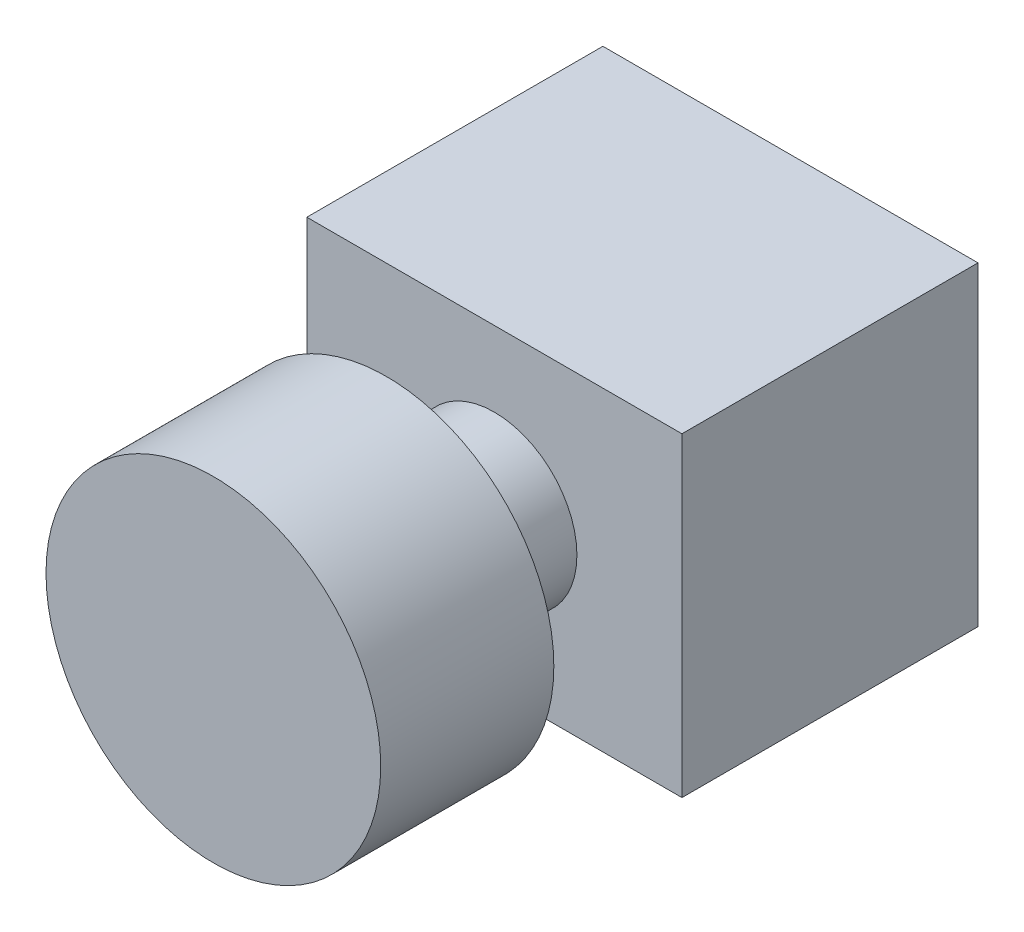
ISO-10303-21;
HEADER;
FILE_DESCRIPTION(('STEP AP214'),'2;1');
FILE_NAME('part.step','',(''),(''),'','','');
FILE_SCHEMA(('AUTOMOTIVE_DESIGN { 1 0 10303 214 1 1 1 1 }'));
ENDSEC;
DATA;
#1=APPLICATION_CONTEXT('core data for automotive mechanical design processes');
#2=APPLICATION_PROTOCOL_DEFINITION('international standard','automotive_design',2000,#1);
#3=PRODUCT_CONTEXT('',#1,'mechanical');
#4=PRODUCT('Part','Part','',(#3));
#5=PRODUCT_RELATED_PRODUCT_CATEGORY('part','',(#4));
#6=PRODUCT_DEFINITION_FORMATION('','',#4);
#7=PRODUCT_DEFINITION_CONTEXT('part definition',#1,'design');
#8=PRODUCT_DEFINITION('design','',#6,#7);
#9=PRODUCT_DEFINITION_SHAPE('','',#8);
#10=(LENGTH_UNIT() NAMED_UNIT(*) SI_UNIT(.MILLI.,.METRE.));
#11=(NAMED_UNIT(*) PLANE_ANGLE_UNIT() SI_UNIT($,.RADIAN.));
#12=(NAMED_UNIT(*) SI_UNIT($,.STERADIAN.) SOLID_ANGLE_UNIT());
#13=UNCERTAINTY_MEASURE_WITH_UNIT(LENGTH_MEASURE(1.E-05),#10,'distance_accuracy_value','');
#14=(GEOMETRIC_REPRESENTATION_CONTEXT(3) GLOBAL_UNCERTAINTY_ASSIGNED_CONTEXT((#13)) GLOBAL_UNIT_ASSIGNED_CONTEXT((#10,
#11,#12)) REPRESENTATION_CONTEXT('',''));
#15=CARTESIAN_POINT('',(0.,0.,0.));
#16=DIRECTION('',(0.,0.,1.));
#17=DIRECTION('',(1.,0.,0.));
#18=AXIS2_PLACEMENT_3D('',#15,#16,#17);
#19=CARTESIAN_POINT('',(0.,0.,25.4));
#20=DIRECTION('',(0.,0.,-1.));
#21=DIRECTION('',(-1.,0.,0.));
#22=AXIS2_PLACEMENT_3D('',#19,#20,#21);
#23=CYLINDRICAL_SURFACE('',#22,3.6322);
#24=CARTESIAN_POINT('',(0.,0.,13.0302));
#25=DIRECTION('',(0.,0.,1.));
#26=DIRECTION('',(1.,0.,0.));
#27=AXIS2_PLACEMENT_3D('',#24,#25,#26);
#28=CIRCLE('',#27,3.6322);
#29=CARTESIAN_POINT('',(3.6322,0.,13.0302));
#30=VERTEX_POINT('',#29);
#31=EDGE_CURVE('E48',#30,#30,#28,.T.);
#32=ORIENTED_EDGE('',*,*,#31,.T.);
#33=EDGE_LOOP('',(#32));
#34=FACE_BOUND('',#33,.T.);
#35=CARTESIAN_POINT('',(0.,0.,17.78));
#36=DIRECTION('',(0.,0.,1.));
#37=DIRECTION('',(1.,0.,0.));
#38=AXIS2_PLACEMENT_3D('',#35,#36,#37);
#39=CIRCLE('',#38,3.6322);
#40=CARTESIAN_POINT('',(3.6322,0.,17.78));
#41=VERTEX_POINT('',#40);
#42=EDGE_CURVE('E11',#41,#41,#39,.T.);
#43=ORIENTED_EDGE('',*,*,#42,.F.);
#44=EDGE_LOOP('',(#43));
#45=FACE_BOUND('',#44,.T.);
#46=ADVANCED_FACE('F39',(#34,#45),#23,.T.);
#47=CARTESIAN_POINT('',(8.255,-6.9342,13.0302));
#48=DIRECTION('',(-1.,0.,0.));
#49=DIRECTION('',(0.,0.,1.));
#50=AXIS2_PLACEMENT_3D('',#47,#48,#49);
#51=PLANE('',#50);
#52=DIRECTION('',(0.,1.,0.));
#53=VECTOR('',#52,1.);
#54=CARTESIAN_POINT('',(8.255,-6.9342,0.));
#55=LINE('',#54,#53);
#56=CARTESIAN_POINT('',(8.255,-6.9342,0.));
#57=VERTEX_POINT('',#56);
#58=CARTESIAN_POINT('',(8.255,6.9342,0.));
#59=VERTEX_POINT('',#58);
#60=EDGE_CURVE('E107',#57,#59,#55,.T.);
#61=ORIENTED_EDGE('',*,*,#60,.T.);
#62=DIRECTION('',(0.,0.,-1.));
#63=VECTOR('',#62,1.);
#64=CARTESIAN_POINT('',(8.255,6.9342,13.0302));
#65=LINE('',#64,#63);
#66=CARTESIAN_POINT('',(8.255,6.9342,13.0302));
#67=VERTEX_POINT('',#66);
#68=EDGE_CURVE('E98',#67,#59,#65,.T.);
#69=ORIENTED_EDGE('',*,*,#68,.F.);
#70=DIRECTION('',(0.,1.,0.));
#71=VECTOR('',#70,1.);
#72=CARTESIAN_POINT('',(8.255,-6.9342,13.0302));
#73=LINE('',#72,#71);
#74=CARTESIAN_POINT('',(8.255,-6.9342,13.0302));
#75=VERTEX_POINT('',#74);
#76=EDGE_CURVE('E92',#75,#67,#73,.T.);
#77=ORIENTED_EDGE('',*,*,#76,.F.);
#78=DIRECTION('',(0.,0.,-1.));
#79=VECTOR('',#78,1.);
#80=CARTESIAN_POINT('',(8.255,-6.9342,13.0302));
#81=LINE('',#80,#79);
#82=EDGE_CURVE('E103',#75,#57,#81,.T.);
#83=ORIENTED_EDGE('',*,*,#82,.T.);
#84=EDGE_LOOP('',(#61,#69,#77,#83));
#85=FACE_BOUND('',#84,.T.);
#86=ADVANCED_FACE('F41',(#85),#51,.F.);
#87=CARTESIAN_POINT('',(-8.255,6.9342,13.0302));
#88=DIRECTION('',(0.,-1.,0.));
#89=DIRECTION('',(0.,0.,-1.));
#90=AXIS2_PLACEMENT_3D('',#87,#88,#89);
#91=PLANE('',#90);
#92=DIRECTION('',(-1.,0.,0.));
#93=VECTOR('',#92,1.);
#94=CARTESIAN_POINT('',(-8.255,6.9342,0.));
#95=LINE('',#94,#93);
#96=CARTESIAN_POINT('',(-8.255,6.9342,0.));
#97=VERTEX_POINT('',#96);
#98=EDGE_CURVE('E97',#59,#97,#95,.T.);
#99=ORIENTED_EDGE('',*,*,#98,.T.);
#100=DIRECTION('',(0.,0.,-1.));
#101=VECTOR('',#100,1.);
#102=CARTESIAN_POINT('',(-8.255,6.9342,13.0302));
#103=LINE('',#102,#101);
#104=CARTESIAN_POINT('',(-8.255,6.9342,13.0302));
#105=VERTEX_POINT('',#104);
#106=EDGE_CURVE('E95',#105,#97,#103,.T.);
#107=ORIENTED_EDGE('',*,*,#106,.F.);
#108=DIRECTION('',(-1.,0.,0.));
#109=VECTOR('',#108,1.);
#110=CARTESIAN_POINT('',(-8.255,6.9342,13.0302));
#111=LINE('',#110,#109);
#112=EDGE_CURVE('E87',#67,#105,#111,.T.);
#113=ORIENTED_EDGE('',*,*,#112,.F.);
#114=ORIENTED_EDGE('',*,*,#68,.T.);
#115=EDGE_LOOP('',(#99,#107,#113,#114));
#116=FACE_BOUND('',#115,.T.);
#117=ADVANCED_FACE('F96',(#116),#91,.F.);
#118=CARTESIAN_POINT('',(-8.255,-6.9342,13.0302));
#119=DIRECTION('',(1.,0.,0.));
#120=DIRECTION('',(0.,0.,-1.));
#121=AXIS2_PLACEMENT_3D('',#118,#119,#120);
#122=PLANE('',#121);
#123=DIRECTION('',(0.,-1.,0.));
#124=VECTOR('',#123,1.);
#125=CARTESIAN_POINT('',(-8.255,-6.9342,0.));
#126=LINE('',#125,#124);
#127=CARTESIAN_POINT('',(-8.255,-6.9342,0.));
#128=VERTEX_POINT('',#127);
#129=EDGE_CURVE('E73',#97,#128,#126,.T.);
#130=ORIENTED_EDGE('',*,*,#129,.T.);
#131=DIRECTION('',(0.,0.,-1.));
#132=VECTOR('',#131,1.);
#133=CARTESIAN_POINT('',(-8.255,-6.9342,13.0302));
#134=LINE('',#133,#132);
#135=CARTESIAN_POINT('',(-8.255,-6.9342,13.0302));
#136=VERTEX_POINT('',#135);
#137=EDGE_CURVE('E99',#136,#128,#134,.T.);
#138=ORIENTED_EDGE('',*,*,#137,.F.);
#139=DIRECTION('',(0.,-1.,0.));
#140=VECTOR('',#139,1.);
#141=CARTESIAN_POINT('',(-8.255,-6.9342,13.0302));
#142=LINE('',#141,#140);
#143=EDGE_CURVE('E90',#105,#136,#142,.T.);
#144=ORIENTED_EDGE('',*,*,#143,.F.);
#145=ORIENTED_EDGE('',*,*,#106,.T.);
#146=EDGE_LOOP('',(#130,#138,#144,#145));
#147=FACE_BOUND('',#146,.T.);
#148=ADVANCED_FACE('F101',(#147),#122,.F.);
#149=CARTESIAN_POINT('',(-8.255,-6.9342,13.0302));
#150=DIRECTION('',(0.,1.,0.));
#151=DIRECTION('',(0.,0.,1.));
#152=AXIS2_PLACEMENT_3D('',#149,#150,#151);
#153=PLANE('',#152);
#154=DIRECTION('',(1.,0.,0.));
#155=VECTOR('',#154,1.);
#156=CARTESIAN_POINT('',(-8.255,-6.9342,0.));
#157=LINE('',#156,#155);
#158=EDGE_CURVE('E79',#128,#57,#157,.T.);
#159=ORIENTED_EDGE('',*,*,#158,.T.);
#160=ORIENTED_EDGE('',*,*,#82,.F.);
#161=DIRECTION('',(1.,0.,0.));
#162=VECTOR('',#161,1.);
#163=CARTESIAN_POINT('',(-8.255,-6.9342,13.0302));
#164=LINE('',#163,#162);
#165=EDGE_CURVE('E56',#136,#75,#164,.T.);
#166=ORIENTED_EDGE('',*,*,#165,.F.);
#167=ORIENTED_EDGE('',*,*,#137,.T.);
#168=EDGE_LOOP('',(#159,#160,#166,#167));
#169=FACE_BOUND('',#168,.T.);
#170=ADVANCED_FACE('F152',(#169),#153,.F.);
#171=CARTESIAN_POINT('',(0.,0.,13.0302));
#172=DIRECTION('',(0.,0.,-1.));
#173=DIRECTION('',(-1.,0.,0.));
#174=AXIS2_PLACEMENT_3D('',#171,#172,#173);
#175=PLANE('',#174);
#176=ORIENTED_EDGE('',*,*,#31,.F.);
#177=EDGE_LOOP('',(#176));
#178=FACE_BOUND('',#177,.T.);
#179=ORIENTED_EDGE('',*,*,#76,.T.);
#180=ORIENTED_EDGE('',*,*,#112,.T.);
#181=ORIENTED_EDGE('',*,*,#143,.T.);
#182=ORIENTED_EDGE('',*,*,#165,.T.);
#183=EDGE_LOOP('',(#179,#180,#181,#182));
#184=FACE_BOUND('',#183,.T.);
#185=ADVANCED_FACE('F88',(#178,#184),#175,.F.);
#186=CARTESIAN_POINT('',(0.,0.,0.));
#187=DIRECTION('',(0.,0.,-1.));
#188=DIRECTION('',(-1.,0.,0.));
#189=AXIS2_PLACEMENT_3D('',#186,#187,#188);
#190=PLANE('',#189);
#191=ORIENTED_EDGE('',*,*,#60,.F.);
#192=ORIENTED_EDGE('',*,*,#158,.F.);
#193=ORIENTED_EDGE('',*,*,#129,.F.);
#194=ORIENTED_EDGE('',*,*,#98,.F.);
#195=EDGE_LOOP('',(#191,#192,#193,#194));
#196=FACE_BOUND('',#195,.T.);
#197=ADVANCED_FACE('F140',(#196),#190,.T.);
#198=CARTESIAN_POINT('',(0.,0.,17.78));
#199=DIRECTION('',(0.,0.,1.));
#200=DIRECTION('',(1.,0.,0.));
#201=AXIS2_PLACEMENT_3D('',#198,#199,#200);
#202=CYLINDRICAL_SURFACE('',#201,7.366);
#203=CARTESIAN_POINT('',(0.,0.,17.78));
#204=DIRECTION('',(0.,0.,1.));
#205=DIRECTION('',(1.,0.,0.));
#206=AXIS2_PLACEMENT_3D('',#203,#204,#205);
#207=CIRCLE('',#206,7.366);
#208=CARTESIAN_POINT('',(7.366,0.,17.78));
#209=VERTEX_POINT('',#208);
#210=EDGE_CURVE('E110',#209,#209,#207,.T.);
#211=CARTESIAN_POINT('',(0.,0.,25.4));
#212=DIRECTION('',(0.,0.,1.));
#213=DIRECTION('',(1.,0.,0.));
#214=AXIS2_PLACEMENT_3D('',#211,#212,#213);
#215=CIRCLE('',#214,7.366);
#216=CARTESIAN_POINT('',(7.366,0.,25.4));
#217=VERTEX_POINT('',#216);
#218=EDGE_CURVE('E120',#217,#217,#215,.T.);
#219=CARTESIAN_POINT('',(7.366,0.,17.78));
#220=CARTESIAN_POINT('',(7.366,0.,17.859375));
#221=CARTESIAN_POINT('',(7.366,0.,17.93875));
#222=CARTESIAN_POINT('',(7.366,0.,18.0975));
#223=CARTESIAN_POINT('',(7.366,0.,18.176875));
#224=CARTESIAN_POINT('',(7.366,0.,18.335625));
#225=CARTESIAN_POINT('',(7.366,0.,18.415));
#226=CARTESIAN_POINT('',(7.366,0.,18.57375));
#227=CARTESIAN_POINT('',(7.366,0.,18.653125));
#228=CARTESIAN_POINT('',(7.366,0.,18.811875));
#229=CARTESIAN_POINT('',(7.366,0.,18.89125));
#230=CARTESIAN_POINT('',(7.366,0.,19.05));
#231=CARTESIAN_POINT('',(7.366,0.,19.129375));
#232=CARTESIAN_POINT('',(7.366,0.,19.288125));
#233=CARTESIAN_POINT('',(7.366,0.,19.3675));
#234=CARTESIAN_POINT('',(7.366,0.,19.52625));
#235=CARTESIAN_POINT('',(7.366,0.,19.605625));
#236=CARTESIAN_POINT('',(7.366,0.,19.764375));
#237=CARTESIAN_POINT('',(7.366,0.,19.84375));
#238=CARTESIAN_POINT('',(7.366,0.,20.0025));
#239=CARTESIAN_POINT('',(7.366,0.,20.081875));
#240=CARTESIAN_POINT('',(7.366,0.,20.240625));
#241=CARTESIAN_POINT('',(7.366,0.,20.32));
#242=CARTESIAN_POINT('',(7.366,0.,20.47875));
#243=CARTESIAN_POINT('',(7.366,0.,20.558125));
#244=CARTESIAN_POINT('',(7.366,0.,20.716875));
#245=CARTESIAN_POINT('',(7.366,0.,20.79625));
#246=CARTESIAN_POINT('',(7.366,0.,20.955));
#247=CARTESIAN_POINT('',(7.366,0.,21.034375));
#248=CARTESIAN_POINT('',(7.366,0.,21.193125));
#249=CARTESIAN_POINT('',(7.366,0.,21.2725));
#250=CARTESIAN_POINT('',(7.366,0.,21.43125));
#251=CARTESIAN_POINT('',(7.366,0.,21.510625));
#252=CARTESIAN_POINT('',(7.366,0.,21.669375));
#253=CARTESIAN_POINT('',(7.366,0.,21.74875));
#254=CARTESIAN_POINT('',(7.366,0.,21.9075));
#255=CARTESIAN_POINT('',(7.366,0.,21.986875));
#256=CARTESIAN_POINT('',(7.366,0.,22.145625));
#257=CARTESIAN_POINT('',(7.366,0.,22.225));
#258=CARTESIAN_POINT('',(7.366,0.,22.38375));
#259=CARTESIAN_POINT('',(7.366,0.,22.463125));
#260=CARTESIAN_POINT('',(7.366,0.,22.621875));
#261=CARTESIAN_POINT('',(7.366,0.,22.70125));
#262=CARTESIAN_POINT('',(7.366,0.,22.86));
#263=CARTESIAN_POINT('',(7.366,0.,22.939375));
#264=CARTESIAN_POINT('',(7.366,0.,23.098125));
#265=CARTESIAN_POINT('',(7.366,0.,23.1775));
#266=CARTESIAN_POINT('',(7.366,0.,23.33625));
#267=CARTESIAN_POINT('',(7.366,0.,23.415625));
#268=CARTESIAN_POINT('',(7.366,0.,23.574375));
#269=CARTESIAN_POINT('',(7.366,0.,23.65375));
#270=CARTESIAN_POINT('',(7.366,0.,23.8125));
#271=CARTESIAN_POINT('',(7.366,0.,23.891875));
#272=CARTESIAN_POINT('',(7.366,0.,24.050625));
#273=CARTESIAN_POINT('',(7.366,0.,24.13));
#274=CARTESIAN_POINT('',(7.366,0.,24.28875));
#275=CARTESIAN_POINT('',(7.366,0.,24.368125));
#276=CARTESIAN_POINT('',(7.366,0.,24.526875));
#277=CARTESIAN_POINT('',(7.366,0.,24.60625));
#278=CARTESIAN_POINT('',(7.366,0.,24.765));
#279=CARTESIAN_POINT('',(7.366,0.,24.844375));
#280=CARTESIAN_POINT('',(7.366,0.,25.003125));
#281=CARTESIAN_POINT('',(7.366,0.,25.0825));
#282=CARTESIAN_POINT('',(7.366,0.,25.24125));
#283=CARTESIAN_POINT('',(7.366,0.,25.320625));
#284=CARTESIAN_POINT('',(7.366,0.,25.4));
#285=B_SPLINE_CURVE_WITH_KNOTS('',3,(#219,#220,#221,#222,#223,#224,#225,#226,#227,#228,#229,
#230,#231,#232,#233,#234,#235,#236,#237,#238,#239,#240,#241,#242,#243,#244,#245,#246,#247,#248,
#249,#250,#251,#252,#253,#254,#255,#256,#257,#258,#259,#260,#261,#262,#263,#264,#265,#266,#267,
#268,#269,#270,#271,#272,#273,#274,#275,#276,#277,#278,#279,#280,#281,#282,#283,#284),
.UNSPECIFIED.,.F.,.F.,(4,2,2,2,2,2,2,2,2,2,2,2,2,2,2,2,2,2,2,2,2,2,2,2,2,2,2,2,2,2,2,2,4),(0.,
0.238125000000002,0.476250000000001,0.714375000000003,0.952500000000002,1.190625,1.42875,
1.666875,1.905,2.143125,2.38125,2.619375,2.8575,3.095625,3.33375,3.571875,3.81,4.048125,4.28625,
4.524375,4.7625,5.000625,5.23875,5.476875,5.715,5.953125,6.19125,6.429375,6.6675,6.905625,
7.14375,7.381875,7.62),.UNSPECIFIED.);
#286=EDGE_CURVE('BSEAM126',#209,#217,#285,.T.);
#287=ORIENTED_EDGE('',*,*,#210,.T.);
#288=ORIENTED_EDGE('',*,*,#218,.F.);
#289=ORIENTED_EDGE('',*,*,#286,.T.);
#290=ORIENTED_EDGE('',*,*,#286,.F.);
#291=EDGE_LOOP('',(#287,#289,#288,#290));
#292=FACE_BOUND('',#291,.T.);
#293=ADVANCED_FACE('F126',(#292),#202,.T.);
#294=CARTESIAN_POINT('',(0.,0.,17.78));
#295=DIRECTION('',(0.,0.,1.));
#296=DIRECTION('',(1.,0.,0.));
#297=AXIS2_PLACEMENT_3D('',#294,#295,#296);
#298=PLANE('',#297);
#299=ORIENTED_EDGE('',*,*,#42,.T.);
#300=EDGE_LOOP('',(#299));
#301=FACE_BOUND('',#300,.T.);
#302=ORIENTED_EDGE('',*,*,#210,.F.);
#303=EDGE_LOOP('',(#302));
#304=FACE_BOUND('',#303,.T.);
#305=ADVANCED_FACE('F129',(#301,#304),#298,.F.);
#306=CARTESIAN_POINT('',(0.,0.,25.4));
#307=DIRECTION('',(0.,0.,1.));
#308=DIRECTION('',(1.,0.,0.));
#309=AXIS2_PLACEMENT_3D('',#306,#307,#308);
#310=PLANE('',#309);
#311=ORIENTED_EDGE('',*,*,#218,.T.);
#312=EDGE_LOOP('',(#311));
#313=FACE_BOUND('',#312,.T.);
#314=ADVANCED_FACE('F131',(#313),#310,.T.);
#315=CLOSED_SHELL('',(#46,#86,#117,#148,#170,#185,#197,#293,#305,#314));
#316=MANIFOLD_SOLID_BREP('B2',#315);
#317=ADVANCED_BREP_SHAPE_REPRESENTATION('',(#18,#316),#14);
#318=SHAPE_DEFINITION_REPRESENTATION(#9,#317);
ENDSEC;
END-ISO-10303-21;
